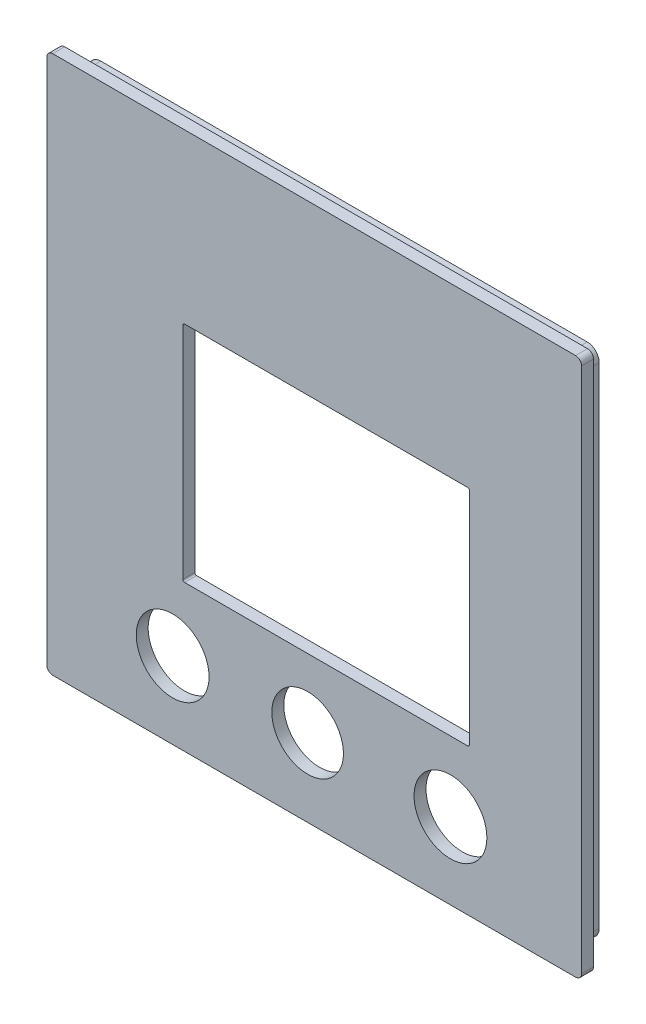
ISO-10303-21;
HEADER;
FILE_DESCRIPTION(('STEP AP214'),'2;1');
FILE_NAME('part.step','',(''),(''),'','','');
FILE_SCHEMA(('AUTOMOTIVE_DESIGN { 1 0 10303 214 1 1 1 1 }'));
ENDSEC;
DATA;
#1=APPLICATION_CONTEXT('core data for automotive mechanical design processes');
#2=APPLICATION_PROTOCOL_DEFINITION('international standard','automotive_design',2000,#1);
#3=PRODUCT_CONTEXT('',#1,'mechanical');
#4=PRODUCT('Part','Part','',(#3));
#5=PRODUCT_RELATED_PRODUCT_CATEGORY('part','',(#4));
#6=PRODUCT_DEFINITION_FORMATION('','',#4);
#7=PRODUCT_DEFINITION_CONTEXT('part definition',#1,'design');
#8=PRODUCT_DEFINITION('design','',#6,#7);
#9=PRODUCT_DEFINITION_SHAPE('','',#8);
#10=(LENGTH_UNIT() NAMED_UNIT(*) SI_UNIT(.MILLI.,.METRE.));
#11=(NAMED_UNIT(*) PLANE_ANGLE_UNIT() SI_UNIT($,.RADIAN.));
#12=(NAMED_UNIT(*) SI_UNIT($,.STERADIAN.) SOLID_ANGLE_UNIT());
#13=UNCERTAINTY_MEASURE_WITH_UNIT(LENGTH_MEASURE(1.E-05),#10,'distance_accuracy_value','');
#14=(GEOMETRIC_REPRESENTATION_CONTEXT(3) GLOBAL_UNCERTAINTY_ASSIGNED_CONTEXT((#13)) GLOBAL_UNIT_ASSIGNED_CONTEXT((#10,
#11,#12)) REPRESENTATION_CONTEXT('',''));
#15=CARTESIAN_POINT('',(0.,0.,0.));
#16=DIRECTION('',(0.,0.,1.));
#17=DIRECTION('',(1.,0.,0.));
#18=AXIS2_PLACEMENT_3D('',#15,#16,#17);
#19=CARTESIAN_POINT('',(0.,0.,0.));
#20=DIRECTION('',(0.,0.,1.));
#21=DIRECTION('',(1.,0.,0.));
#22=AXIS2_PLACEMENT_3D('',#19,#20,#21);
#23=PLANE('',#22);
#24=DIRECTION('',(0.,-1.,0.));
#25=VECTOR('',#24,1.);
#26=CARTESIAN_POINT('',(-112.975,-14.244211,0.));
#27=LINE('',#26,#25);
#28=CARTESIAN_POINT('',(-112.975,-15.244211,0.));
#29=VERTEX_POINT('',#28);
#30=CARTESIAN_POINT('',(-112.975,-103.444211,0.));
#31=VERTEX_POINT('',#30);
#32=EDGE_CURVE('E444',#29,#31,#27,.T.);
#33=ORIENTED_EDGE('',*,*,#32,.F.);
#34=CARTESIAN_POINT('',(-111.975,-15.244211,0.));
#35=DIRECTION('',(0.,0.,-1.));
#36=DIRECTION('',(-1.,0.,0.));
#37=AXIS2_PLACEMENT_3D('',#34,#35,#36);
#38=CIRCLE('',#37,1.);
#39=CARTESIAN_POINT('',(-111.975,-14.244211,0.));
#40=VERTEX_POINT('',#39);
#41=EDGE_CURVE('E605',#29,#40,#38,.T.);
#42=ORIENTED_EDGE('',*,*,#41,.T.);
#43=DIRECTION('',(-1.,0.,0.));
#44=VECTOR('',#43,1.);
#45=CARTESIAN_POINT('',(-112.975,-14.244211,0.));
#46=LINE('',#45,#44);
#47=CARTESIAN_POINT('',(-24.375,-14.244211,0.));
#48=VERTEX_POINT('',#47);
#49=EDGE_CURVE('E440',#48,#40,#46,.T.);
#50=ORIENTED_EDGE('',*,*,#49,.F.);
#51=CARTESIAN_POINT('',(-24.375,-15.244211,0.));
#52=DIRECTION('',(0.,0.,-1.));
#53=DIRECTION('',(-1.,0.,0.));
#54=AXIS2_PLACEMENT_3D('',#51,#52,#53);
#55=CIRCLE('',#54,1.);
#56=CARTESIAN_POINT('',(-23.375,-15.244211,0.));
#57=VERTEX_POINT('',#56);
#58=EDGE_CURVE('E602',#48,#57,#55,.T.);
#59=ORIENTED_EDGE('',*,*,#58,.T.);
#60=DIRECTION('',(0.,1.,0.));
#61=VECTOR('',#60,1.);
#62=CARTESIAN_POINT('',(-23.375,-14.244211,0.));
#63=LINE('',#62,#61);
#64=CARTESIAN_POINT('',(-23.375,-103.444211,0.));
#65=VERTEX_POINT('',#64);
#66=EDGE_CURVE('E453',#65,#57,#63,.T.);
#67=ORIENTED_EDGE('',*,*,#66,.F.);
#68=CARTESIAN_POINT('',(-24.375,-103.444211,0.));
#69=DIRECTION('',(0.,0.,-1.));
#70=DIRECTION('',(-1.,0.,0.));
#71=AXIS2_PLACEMENT_3D('',#68,#69,#70);
#72=CIRCLE('',#71,1.);
#73=CARTESIAN_POINT('',(-24.375,-104.444211,0.));
#74=VERTEX_POINT('',#73);
#75=EDGE_CURVE('E596',#65,#74,#72,.T.);
#76=ORIENTED_EDGE('',*,*,#75,.T.);
#77=DIRECTION('',(1.,0.,0.));
#78=VECTOR('',#77,1.);
#79=CARTESIAN_POINT('',(-112.975,-104.444211,0.));
#80=LINE('',#79,#78);
#81=CARTESIAN_POINT('',(-111.975,-104.444211,0.));
#82=VERTEX_POINT('',#81);
#83=EDGE_CURVE('E449',#82,#74,#80,.T.);
#84=ORIENTED_EDGE('',*,*,#83,.F.);
#85=CARTESIAN_POINT('',(-111.975,-103.444211,0.));
#86=DIRECTION('',(0.,0.,-1.));
#87=DIRECTION('',(-1.,0.,0.));
#88=AXIS2_PLACEMENT_3D('',#85,#86,#87);
#89=CIRCLE('',#88,1.);
#90=EDGE_CURVE('E599',#82,#31,#89,.T.);
#91=ORIENTED_EDGE('',*,*,#90,.T.);
#92=EDGE_LOOP('',(#33,#42,#50,#59,#67,#76,#84,#91));
#93=FACE_BOUND('',#92,.T.);
#94=CARTESIAN_POINT('',(-108.925,-18.294211,0.));
#95=DIRECTION('',(0.,0.,-1.));
#96=DIRECTION('',(1.,0.,0.));
#97=AXIS2_PLACEMENT_3D('',#94,#95,#96);
#98=CIRCLE('',#97,2.);
#99=CARTESIAN_POINT('',(-110.925,-18.294211,0.));
#100=VERTEX_POINT('',#99);
#101=CARTESIAN_POINT('',(-108.925,-16.294211,0.));
#102=VERTEX_POINT('',#101);
#103=EDGE_CURVE('E273',#100,#102,#98,.T.);
#104=ORIENTED_EDGE('',*,*,#103,.F.);
#105=DIRECTION('',(0.,1.,0.));
#106=VECTOR('',#105,1.);
#107=CARTESIAN_POINT('',(-110.925,-18.294211,0.));
#108=LINE('',#107,#106);
#109=CARTESIAN_POINT('',(-110.925,-100.394211,0.));
#110=VERTEX_POINT('',#109);
#111=EDGE_CURVE('E353',#110,#100,#108,.T.);
#112=ORIENTED_EDGE('',*,*,#111,.F.);
#113=CARTESIAN_POINT('',(-108.925,-100.394211,0.));
#114=DIRECTION('',(0.,0.,-1.));
#115=DIRECTION('',(-1.,0.,0.));
#116=AXIS2_PLACEMENT_3D('',#113,#114,#115);
#117=CIRCLE('',#116,1.99999999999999);
#118=CARTESIAN_POINT('',(-108.925,-102.394211,0.));
#119=VERTEX_POINT('',#118);
#120=EDGE_CURVE('E394',#119,#110,#117,.T.);
#121=ORIENTED_EDGE('',*,*,#120,.F.);
#122=DIRECTION('',(-1.,0.,0.));
#123=VECTOR('',#122,1.);
#124=CARTESIAN_POINT('',(-27.425,-102.394211,0.));
#125=LINE('',#124,#123);
#126=CARTESIAN_POINT('',(-27.425,-102.394211,0.));
#127=VERTEX_POINT('',#126);
#128=EDGE_CURVE('E390',#127,#119,#125,.T.);
#129=ORIENTED_EDGE('',*,*,#128,.F.);
#130=CARTESIAN_POINT('',(-27.425,-100.394211,0.));
#131=DIRECTION('',(0.,0.,-1.));
#132=DIRECTION('',(-1.,0.,0.));
#133=AXIS2_PLACEMENT_3D('',#130,#131,#132);
#134=CIRCLE('',#133,2.);
#135=CARTESIAN_POINT('',(-25.425,-100.394211,0.));
#136=VERTEX_POINT('',#135);
#137=EDGE_CURVE('E386',#136,#127,#134,.T.);
#138=ORIENTED_EDGE('',*,*,#137,.F.);
#139=DIRECTION('',(0.,-1.,0.));
#140=VECTOR('',#139,1.);
#141=CARTESIAN_POINT('',(-25.425,-18.294211,0.));
#142=LINE('',#141,#140);
#143=CARTESIAN_POINT('',(-25.425,-18.294211,0.));
#144=VERTEX_POINT('',#143);
#145=EDGE_CURVE('E382',#144,#136,#142,.T.);
#146=ORIENTED_EDGE('',*,*,#145,.F.);
#147=CARTESIAN_POINT('',(-27.425,-18.294211,0.));
#148=DIRECTION('',(0.,0.,-1.));
#149=DIRECTION('',(-1.,0.,0.));
#150=AXIS2_PLACEMENT_3D('',#147,#148,#149);
#151=CIRCLE('',#150,2.);
#152=CARTESIAN_POINT('',(-27.425,-16.294211,0.));
#153=VERTEX_POINT('',#152);
#154=EDGE_CURVE('E66',#153,#144,#151,.T.);
#155=ORIENTED_EDGE('',*,*,#154,.F.);
#156=DIRECTION('',(1.,0.,0.));
#157=VECTOR('',#156,1.);
#158=CARTESIAN_POINT('',(-27.425,-16.294211,0.));
#159=LINE('',#158,#157);
#160=EDGE_CURVE('E61',#102,#153,#159,.T.);
#161=ORIENTED_EDGE('',*,*,#160,.F.);
#162=EDGE_LOOP('',(#104,#112,#121,#129,#138,#146,#155,#161));
#163=FACE_BOUND('',#162,.T.);
#164=ADVANCED_FACE('F45',(#93,#163),#23,.F.);
#165=CARTESIAN_POINT('',(-42.1750000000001,0.,2.));
#166=DIRECTION('',(-1.,0.,0.));
#167=DIRECTION('',(0.,-1.,0.));
#168=AXIS2_PLACEMENT_3D('',#165,#166,#167);
#169=PLANE('',#168);
#170=DIRECTION('',(0.,1.,0.));
#171=VECTOR('',#170,1.);
#172=CARTESIAN_POINT('',(-42.1750000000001,0.,0.));
#173=LINE('',#172,#171);
#174=CARTESIAN_POINT('',(-42.175,-79.624211,0.));
#175=VERTEX_POINT('',#174);
#176=CARTESIAN_POINT('',(-42.175,-42.724211,0.));
#177=VERTEX_POINT('',#176);
#178=EDGE_CURVE('E504',#175,#177,#173,.T.);
#179=ORIENTED_EDGE('',*,*,#178,.F.);
#180=DIRECTION('',(0.,0.,-1.));
#181=VECTOR('',#180,1.);
#182=CARTESIAN_POINT('',(-42.175,-79.624211,2.));
#183=LINE('',#182,#181);
#184=CARTESIAN_POINT('',(-42.175,-79.624211,2.));
#185=VERTEX_POINT('',#184);
#186=EDGE_CURVE('E521',#175,#185,#183,.F.);
#187=ORIENTED_EDGE('',*,*,#186,.T.);
#188=DIRECTION('',(0.,1.,0.));
#189=VECTOR('',#188,1.);
#190=CARTESIAN_POINT('',(-42.1750000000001,0.,2.));
#191=LINE('',#190,#189);
#192=CARTESIAN_POINT('',(-42.175,-42.724211,2.));
#193=VERTEX_POINT('',#192);
#194=EDGE_CURVE('E485',#185,#193,#191,.T.);
#195=ORIENTED_EDGE('',*,*,#194,.T.);
#196=DIRECTION('',(0.,0.,-1.));
#197=VECTOR('',#196,1.);
#198=CARTESIAN_POINT('',(-42.175,-42.724211,0.));
#199=LINE('',#198,#197);
#200=EDGE_CURVE('E517',#193,#177,#199,.T.);
#201=ORIENTED_EDGE('',*,*,#200,.T.);
#202=EDGE_LOOP('',(#179,#187,#195,#201));
#203=FACE_BOUND('',#202,.T.);
#204=ADVANCED_FACE('F663',(#203),#169,.T.);
#205=CARTESIAN_POINT('',(0.,-79.9242109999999,2.));
#206=DIRECTION('',(0.,1.,0.));
#207=DIRECTION('',(-1.,0.,0.));
#208=AXIS2_PLACEMENT_3D('',#205,#206,#207);
#209=PLANE('',#208);
#210=DIRECTION('',(1.,0.,0.));
#211=VECTOR('',#210,1.);
#212=CARTESIAN_POINT('',(0.,-79.9242109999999,0.));
#213=LINE('',#212,#211);
#214=CARTESIAN_POINT('',(-89.875,-79.924211,0.));
#215=VERTEX_POINT('',#214);
#216=CARTESIAN_POINT('',(-42.475,-79.924211,0.));
#217=VERTEX_POINT('',#216);
#218=EDGE_CURVE('E508',#215,#217,#213,.T.);
#219=ORIENTED_EDGE('',*,*,#218,.F.);
#220=DIRECTION('',(0.,0.,1.));
#221=VECTOR('',#220,1.);
#222=CARTESIAN_POINT('',(-89.875,-79.924211,2.));
#223=LINE('',#222,#221);
#224=CARTESIAN_POINT('',(-89.875,-79.924211,2.));
#225=VERTEX_POINT('',#224);
#226=EDGE_CURVE('E554',#215,#225,#223,.T.);
#227=ORIENTED_EDGE('',*,*,#226,.T.);
#228=DIRECTION('',(1.,0.,0.));
#229=VECTOR('',#228,1.);
#230=CARTESIAN_POINT('',(0.,-79.9242109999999,2.));
#231=LINE('',#230,#229);
#232=CARTESIAN_POINT('',(-42.475,-79.924211,2.));
#233=VERTEX_POINT('',#232);
#234=EDGE_CURVE('E489',#225,#233,#231,.T.);
#235=ORIENTED_EDGE('',*,*,#234,.T.);
#236=DIRECTION('',(0.,0.,-1.));
#237=VECTOR('',#236,1.);
#238=CARTESIAN_POINT('',(-42.475,-79.924211,0.));
#239=LINE('',#238,#237);
#240=EDGE_CURVE('E496',#233,#217,#239,.T.);
#241=ORIENTED_EDGE('',*,*,#240,.T.);
#242=EDGE_LOOP('',(#219,#227,#235,#241));
#243=FACE_BOUND('',#242,.T.);
#244=ADVANCED_FACE('F669',(#243),#209,.T.);
#245=CARTESIAN_POINT('',(0.,-42.4242109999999,2.));
#246=DIRECTION('',(0.,-1.,0.));
#247=DIRECTION('',(1.,0.,0.));
#248=AXIS2_PLACEMENT_3D('',#245,#246,#247);
#249=PLANE('',#248);
#250=DIRECTION('',(-1.,0.,0.));
#251=VECTOR('',#250,1.);
#252=CARTESIAN_POINT('',(0.,-42.4242109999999,2.));
#253=LINE('',#252,#251);
#254=CARTESIAN_POINT('',(-42.475,-42.424211,2.));
#255=VERTEX_POINT('',#254);
#256=CARTESIAN_POINT('',(-89.8750000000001,-42.424211,2.));
#257=VERTEX_POINT('',#256);
#258=EDGE_CURVE('E492',#255,#257,#253,.T.);
#259=ORIENTED_EDGE('',*,*,#258,.T.);
#260=DIRECTION('',(0.,0.,1.));
#261=VECTOR('',#260,1.);
#262=CARTESIAN_POINT('',(-89.8750000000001,-42.424211,0.));
#263=LINE('',#262,#261);
#264=CARTESIAN_POINT('',(-89.8750000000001,-42.424211,0.));
#265=VERTEX_POINT('',#264);
#266=EDGE_CURVE('E551',#257,#265,#263,.F.);
#267=ORIENTED_EDGE('',*,*,#266,.T.);
#268=DIRECTION('',(-1.,0.,0.));
#269=VECTOR('',#268,1.);
#270=CARTESIAN_POINT('',(0.,-42.4242109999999,0.));
#271=LINE('',#270,#269);
#272=CARTESIAN_POINT('',(-42.475,-42.424211,0.));
#273=VERTEX_POINT('',#272);
#274=EDGE_CURVE('E481',#273,#265,#271,.T.);
#275=ORIENTED_EDGE('',*,*,#274,.F.);
#276=DIRECTION('',(0.,0.,-1.));
#277=VECTOR('',#276,1.);
#278=CARTESIAN_POINT('',(-42.475,-42.424211,2.));
#279=LINE('',#278,#277);
#280=EDGE_CURVE('E524',#273,#255,#279,.F.);
#281=ORIENTED_EDGE('',*,*,#280,.T.);
#282=EDGE_LOOP('',(#259,#267,#275,#281));
#283=FACE_BOUND('',#282,.T.);
#284=ADVANCED_FACE('F699',(#283),#249,.T.);
#285=CARTESIAN_POINT('',(-91.8933045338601,-91.5775033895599,2.));
#286=DIRECTION('',(0.,0.,-1.));
#287=DIRECTION('',(-1.,0.,0.));
#288=AXIS2_PLACEMENT_3D('',#285,#286,#287);
#289=CYLINDRICAL_SURFACE('',#288,6.09999999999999);
#290=CARTESIAN_POINT('',(-91.8933045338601,-91.5775033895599,2.));
#291=DIRECTION('',(0.,0.,1.));
#292=DIRECTION('',(1.,0.,0.));
#293=AXIS2_PLACEMENT_3D('',#290,#291,#292);
#294=CIRCLE('',#293,6.09999999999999);
#295=CARTESIAN_POINT('',(-85.7933045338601,-91.5775033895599,2.));
#296=VERTEX_POINT('',#295);
#297=EDGE_CURVE('E480',#296,#296,#294,.T.);
#298=ORIENTED_EDGE('',*,*,#297,.T.);
#299=EDGE_LOOP('',(#298));
#300=FACE_BOUND('',#299,.T.);
#301=CARTESIAN_POINT('',(-91.8933045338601,-91.5775033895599,0.));
#302=DIRECTION('',(0.,0.,1.));
#303=DIRECTION('',(1.,0.,0.));
#304=AXIS2_PLACEMENT_3D('',#301,#302,#303);
#305=CIRCLE('',#304,6.09999999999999);
#306=CARTESIAN_POINT('',(-85.7933045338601,-91.5775033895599,0.));
#307=VERTEX_POINT('',#306);
#308=EDGE_CURVE('E500',#307,#307,#305,.T.);
#309=ORIENTED_EDGE('',*,*,#308,.F.);
#310=EDGE_LOOP('',(#309));
#311=FACE_BOUND('',#310,.T.);
#312=ADVANCED_FACE('F697',(#300,#311),#289,.F.);
#313=CARTESIAN_POINT('',(-45.3451344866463,-91.6534854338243,2.));
#314=DIRECTION('',(0.,0.,-1.));
#315=DIRECTION('',(-1.,0.,0.));
#316=AXIS2_PLACEMENT_3D('',#313,#314,#315);
#317=CYLINDRICAL_SURFACE('',#316,6.1);
#318=CARTESIAN_POINT('',(-45.3451344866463,-91.6534854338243,2.));
#319=DIRECTION('',(0.,0.,1.));
#320=DIRECTION('',(1.,0.,0.));
#321=AXIS2_PLACEMENT_3D('',#318,#319,#320);
#322=CIRCLE('',#321,6.1);
#323=CARTESIAN_POINT('',(-39.2451344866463,-91.6534854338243,2.));
#324=VERTEX_POINT('',#323);
#325=EDGE_CURVE('E476',#324,#324,#322,.T.);
#326=ORIENTED_EDGE('',*,*,#325,.T.);
#327=EDGE_LOOP('',(#326));
#328=FACE_BOUND('',#327,.T.);
#329=CARTESIAN_POINT('',(-45.3451344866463,-91.6534854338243,0.));
#330=DIRECTION('',(0.,0.,1.));
#331=DIRECTION('',(1.,0.,0.));
#332=AXIS2_PLACEMENT_3D('',#329,#330,#331);
#333=CIRCLE('',#332,6.1);
#334=CARTESIAN_POINT('',(-39.2451344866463,-91.6534854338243,0.));
#335=VERTEX_POINT('',#334);
#336=EDGE_CURVE('E475',#335,#335,#333,.T.);
#337=ORIENTED_EDGE('',*,*,#336,.F.);
#338=EDGE_LOOP('',(#337));
#339=FACE_BOUND('',#338,.T.);
#340=ADVANCED_FACE('F684',(#328,#339),#317,.F.);
#341=CARTESIAN_POINT('',(0.,0.,2.));
#342=DIRECTION('',(0.,0.,1.));
#343=DIRECTION('',(1.,0.,0.));
#344=AXIS2_PLACEMENT_3D('',#341,#342,#343);
#345=PLANE('',#344);
#346=ORIENTED_EDGE('',*,*,#234,.F.);
#347=CARTESIAN_POINT('',(-89.875,-79.624211,2.));
#348=DIRECTION('',(0.,0.,1.));
#349=DIRECTION('',(1.,0.,0.));
#350=AXIS2_PLACEMENT_3D('',#347,#348,#349);
#351=CIRCLE('',#350,0.3);
#352=CARTESIAN_POINT('',(-90.175,-79.624211,2.));
#353=VERTEX_POINT('',#352);
#354=EDGE_CURVE('E564',#225,#353,#351,.F.);
#355=ORIENTED_EDGE('',*,*,#354,.T.);
#356=DIRECTION('',(0.,1.,0.));
#357=VECTOR('',#356,1.);
#358=CARTESIAN_POINT('',(-90.175,-42.424211,2.));
#359=LINE('',#358,#357);
#360=CARTESIAN_POINT('',(-90.175,-42.724211,2.));
#361=VERTEX_POINT('',#360);
#362=EDGE_CURVE('E431',#353,#361,#359,.T.);
#363=ORIENTED_EDGE('',*,*,#362,.T.);
#364=CARTESIAN_POINT('',(-89.8750000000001,-42.724211,2.));
#365=DIRECTION('',(0.,0.,1.));
#366=DIRECTION('',(1.,0.,0.));
#367=AXIS2_PLACEMENT_3D('',#364,#365,#366);
#368=CIRCLE('',#367,0.3);
#369=EDGE_CURVE('E558',#361,#257,#368,.F.);
#370=ORIENTED_EDGE('',*,*,#369,.T.);
#371=ORIENTED_EDGE('',*,*,#258,.F.);
#372=CARTESIAN_POINT('',(-42.475,-42.724211,2.));
#373=DIRECTION('',(0.,0.,1.));
#374=DIRECTION('',(1.,0.,0.));
#375=AXIS2_PLACEMENT_3D('',#372,#373,#374);
#376=CIRCLE('',#375,0.3);
#377=EDGE_CURVE('E537',#255,#193,#376,.F.);
#378=ORIENTED_EDGE('',*,*,#377,.T.);
#379=ORIENTED_EDGE('',*,*,#194,.F.);
#380=CARTESIAN_POINT('',(-42.475,-79.624211,2.));
#381=DIRECTION('',(0.,0.,1.));
#382=DIRECTION('',(1.,0.,0.));
#383=AXIS2_PLACEMENT_3D('',#380,#381,#382);
#384=CIRCLE('',#383,0.3);
#385=EDGE_CURVE('E530',#185,#233,#384,.F.);
#386=ORIENTED_EDGE('',*,*,#385,.T.);
#387=EDGE_LOOP('',(#346,#355,#363,#370,#371,#378,#379,#386));
#388=FACE_BOUND('',#387,.T.);
#389=CARTESIAN_POINT('',(-69.275,-91.444211,2.));
#390=DIRECTION('',(0.,0.,1.));
#391=DIRECTION('',(1.,0.,0.));
#392=AXIS2_PLACEMENT_3D('',#389,#390,#391);
#393=CIRCLE('',#392,6.);
#394=CARTESIAN_POINT('',(-63.275,-91.444211,2.));
#395=VERTEX_POINT('',#394);
#396=EDGE_CURVE('E457',#395,#395,#393,.T.);
#397=ORIENTED_EDGE('',*,*,#396,.F.);
#398=EDGE_LOOP('',(#397));
#399=FACE_BOUND('',#398,.T.);
#400=ORIENTED_EDGE('',*,*,#325,.F.);
#401=EDGE_LOOP('',(#400));
#402=FACE_BOUND('',#401,.T.);
#403=ORIENTED_EDGE('',*,*,#297,.F.);
#404=EDGE_LOOP('',(#403));
#405=FACE_BOUND('',#404,.T.);
#406=DIRECTION('',(-1.,0.,0.));
#407=VECTOR('',#406,1.);
#408=CARTESIAN_POINT('',(-112.975,-14.244211,2.));
#409=LINE('',#408,#407);
#410=CARTESIAN_POINT('',(-24.375,-14.244211,2.));
#411=VERTEX_POINT('',#410);
#412=CARTESIAN_POINT('',(-111.975,-14.244211,2.));
#413=VERTEX_POINT('',#412);
#414=EDGE_CURVE('E436',#411,#413,#409,.T.);
#415=ORIENTED_EDGE('',*,*,#414,.T.);
#416=CARTESIAN_POINT('',(-111.975,-15.244211,2.));
#417=DIRECTION('',(0.,0.,1.));
#418=DIRECTION('',(1.,0.,0.));
#419=AXIS2_PLACEMENT_3D('',#416,#417,#418);
#420=CIRCLE('',#419,1.);
#421=CARTESIAN_POINT('',(-112.975,-15.244211,2.));
#422=VERTEX_POINT('',#421);
#423=EDGE_CURVE('E586',#413,#422,#420,.T.);
#424=ORIENTED_EDGE('',*,*,#423,.T.);
#425=DIRECTION('',(0.,-1.,0.));
#426=VECTOR('',#425,1.);
#427=CARTESIAN_POINT('',(-112.975,-14.244211,2.));
#428=LINE('',#427,#426);
#429=CARTESIAN_POINT('',(-112.975,-103.444211,2.));
#430=VERTEX_POINT('',#429);
#431=EDGE_CURVE('E461',#422,#430,#428,.T.);
#432=ORIENTED_EDGE('',*,*,#431,.T.);
#433=CARTESIAN_POINT('',(-111.975,-103.444211,2.));
#434=DIRECTION('',(0.,0.,1.));
#435=DIRECTION('',(1.,0.,0.));
#436=AXIS2_PLACEMENT_3D('',#433,#434,#435);
#437=CIRCLE('',#436,1.);
#438=CARTESIAN_POINT('',(-111.975,-104.444211,2.));
#439=VERTEX_POINT('',#438);
#440=EDGE_CURVE('E580',#430,#439,#437,.T.);
#441=ORIENTED_EDGE('',*,*,#440,.T.);
#442=DIRECTION('',(1.,0.,0.));
#443=VECTOR('',#442,1.);
#444=CARTESIAN_POINT('',(-112.975,-104.444211,2.));
#445=LINE('',#444,#443);
#446=CARTESIAN_POINT('',(-24.375,-104.444211,2.));
#447=VERTEX_POINT('',#446);
#448=EDGE_CURVE('E465',#439,#447,#445,.T.);
#449=ORIENTED_EDGE('',*,*,#448,.T.);
#450=CARTESIAN_POINT('',(-24.375,-103.444211,2.));
#451=DIRECTION('',(0.,0.,1.));
#452=DIRECTION('',(1.,0.,0.));
#453=AXIS2_PLACEMENT_3D('',#450,#451,#452);
#454=CIRCLE('',#453,1.);
#455=CARTESIAN_POINT('',(-23.375,-103.444211,2.));
#456=VERTEX_POINT('',#455);
#457=EDGE_CURVE('E577',#447,#456,#454,.T.);
#458=ORIENTED_EDGE('',*,*,#457,.T.);
#459=DIRECTION('',(0.,1.,0.));
#460=VECTOR('',#459,1.);
#461=CARTESIAN_POINT('',(-23.375,-14.244211,2.));
#462=LINE('',#461,#460);
#463=CARTESIAN_POINT('',(-23.375,-15.244211,2.));
#464=VERTEX_POINT('',#463);
#465=EDGE_CURVE('E445',#456,#464,#462,.T.);
#466=ORIENTED_EDGE('',*,*,#465,.T.);
#467=CARTESIAN_POINT('',(-24.375,-15.244211,2.));
#468=DIRECTION('',(0.,0.,1.));
#469=DIRECTION('',(1.,0.,0.));
#470=AXIS2_PLACEMENT_3D('',#467,#468,#469);
#471=CIRCLE('',#470,1.);
#472=EDGE_CURVE('E583',#464,#411,#471,.T.);
#473=ORIENTED_EDGE('',*,*,#472,.T.);
#474=EDGE_LOOP('',(#415,#424,#432,#441,#449,#458,#466,#473));
#475=FACE_BOUND('',#474,.T.);
#476=ADVANCED_FACE('F625',(#388,#399,#402,#405,#475),#345,.T.);
#477=DIRECTION('',(1.,0.,0.));
#478=VECTOR('',#477,1.);
#479=CARTESIAN_POINT('',(-27.425,-17.794211,0.));
#480=LINE('',#479,#478);
#481=CARTESIAN_POINT('',(-108.925,-17.794211,0.));
#482=VERTEX_POINT('',#481);
#483=CARTESIAN_POINT('',(-27.425,-17.794211,0.));
#484=VERTEX_POINT('',#483);
#485=EDGE_CURVE('E265',#482,#484,#480,.T.);
#486=ORIENTED_EDGE('',*,*,#485,.T.);
#487=CARTESIAN_POINT('',(-27.425,-18.294211,0.));
#488=DIRECTION('',(0.,0.,-1.));
#489=DIRECTION('',(-1.,0.,0.));
#490=AXIS2_PLACEMENT_3D('',#487,#488,#489);
#491=CIRCLE('',#490,0.5);
#492=CARTESIAN_POINT('',(-26.925,-18.294211,0.));
#493=VERTEX_POINT('',#492);
#494=EDGE_CURVE('E301',#484,#493,#491,.T.);
#495=ORIENTED_EDGE('',*,*,#494,.T.);
#496=DIRECTION('',(0.,-1.,0.));
#497=VECTOR('',#496,1.);
#498=CARTESIAN_POINT('',(-26.925,-18.294211,0.));
#499=LINE('',#498,#497);
#500=CARTESIAN_POINT('',(-26.925,-100.394211,0.));
#501=VERTEX_POINT('',#500);
#502=EDGE_CURVE('E271',#493,#501,#499,.T.);
#503=ORIENTED_EDGE('',*,*,#502,.T.);
#504=CARTESIAN_POINT('',(-27.425,-100.394211,0.));
#505=DIRECTION('',(0.,0.,-1.));
#506=DIRECTION('',(-1.,0.,0.));
#507=AXIS2_PLACEMENT_3D('',#504,#505,#506);
#508=CIRCLE('',#507,0.5);
#509=CARTESIAN_POINT('',(-27.425,-100.894211,0.));
#510=VERTEX_POINT('',#509);
#511=EDGE_CURVE('E306',#501,#510,#508,.T.);
#512=ORIENTED_EDGE('',*,*,#511,.T.);
#513=DIRECTION('',(-1.,0.,0.));
#514=VECTOR('',#513,1.);
#515=CARTESIAN_POINT('',(-27.425,-100.894211,0.));
#516=LINE('',#515,#514);
#517=CARTESIAN_POINT('',(-108.925,-100.894211,0.));
#518=VERTEX_POINT('',#517);
#519=EDGE_CURVE('E310',#510,#518,#516,.T.);
#520=ORIENTED_EDGE('',*,*,#519,.T.);
#521=CARTESIAN_POINT('',(-108.925,-100.394211,0.));
#522=DIRECTION('',(0.,0.,-1.));
#523=DIRECTION('',(-1.,0.,0.));
#524=AXIS2_PLACEMENT_3D('',#521,#522,#523);
#525=CIRCLE('',#524,0.5);
#526=CARTESIAN_POINT('',(-109.425,-100.394211,0.));
#527=VERTEX_POINT('',#526);
#528=EDGE_CURVE('E314',#518,#527,#525,.T.);
#529=ORIENTED_EDGE('',*,*,#528,.T.);
#530=DIRECTION('',(0.,1.,0.));
#531=VECTOR('',#530,1.);
#532=CARTESIAN_POINT('',(-109.425,-18.294211,0.));
#533=LINE('',#532,#531);
#534=CARTESIAN_POINT('',(-109.425,-18.294211,0.));
#535=VERTEX_POINT('',#534);
#536=EDGE_CURVE('E318',#527,#535,#533,.T.);
#537=ORIENTED_EDGE('',*,*,#536,.T.);
#538=CARTESIAN_POINT('',(-108.925,-18.294211,0.));
#539=DIRECTION('',(0.,0.,-1.));
#540=DIRECTION('',(1.,0.,0.));
#541=AXIS2_PLACEMENT_3D('',#538,#539,#540);
#542=CIRCLE('',#541,0.5);
#543=EDGE_CURVE('E322',#535,#482,#542,.T.);
#544=ORIENTED_EDGE('',*,*,#543,.T.);
#545=EDGE_LOOP('',(#486,#495,#503,#512,#520,#529,#537,#544));
#546=FACE_BOUND('',#545,.T.);
#547=ORIENTED_EDGE('',*,*,#274,.T.);
#548=CARTESIAN_POINT('',(-89.8750000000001,-42.724211,0.));
#549=DIRECTION('',(0.,0.,1.));
#550=DIRECTION('',(1.,0.,0.));
#551=AXIS2_PLACEMENT_3D('',#548,#549,#550);
#552=CIRCLE('',#551,0.3);
#553=CARTESIAN_POINT('',(-90.175,-42.724211,0.));
#554=VERTEX_POINT('',#553);
#555=EDGE_CURVE('E561',#265,#554,#552,.T.);
#556=ORIENTED_EDGE('',*,*,#555,.T.);
#557=DIRECTION('',(0.,-1.,0.));
#558=VECTOR('',#557,1.);
#559=CARTESIAN_POINT('',(-90.175,-42.424211,0.));
#560=LINE('',#559,#558);
#561=CARTESIAN_POINT('',(-90.175,-79.624211,0.));
#562=VERTEX_POINT('',#561);
#563=EDGE_CURVE('E432',#554,#562,#560,.T.);
#564=ORIENTED_EDGE('',*,*,#563,.T.);
#565=CARTESIAN_POINT('',(-89.875,-79.624211,0.));
#566=DIRECTION('',(0.,0.,1.));
#567=DIRECTION('',(1.,0.,0.));
#568=AXIS2_PLACEMENT_3D('',#565,#566,#567);
#569=CIRCLE('',#568,0.3);
#570=EDGE_CURVE('E567',#562,#215,#569,.T.);
#571=ORIENTED_EDGE('',*,*,#570,.T.);
#572=ORIENTED_EDGE('',*,*,#218,.T.);
#573=CARTESIAN_POINT('',(-42.475,-79.624211,0.));
#574=DIRECTION('',(0.,0.,1.));
#575=DIRECTION('',(1.,0.,0.));
#576=AXIS2_PLACEMENT_3D('',#573,#574,#575);
#577=CIRCLE('',#576,0.3);
#578=EDGE_CURVE('E527',#217,#175,#577,.T.);
#579=ORIENTED_EDGE('',*,*,#578,.T.);
#580=ORIENTED_EDGE('',*,*,#178,.T.);
#581=CARTESIAN_POINT('',(-42.475,-42.724211,0.));
#582=DIRECTION('',(0.,0.,1.));
#583=DIRECTION('',(1.,0.,0.));
#584=AXIS2_PLACEMENT_3D('',#581,#582,#583);
#585=CIRCLE('',#584,0.3);
#586=EDGE_CURVE('E534',#177,#273,#585,.T.);
#587=ORIENTED_EDGE('',*,*,#586,.T.);
#588=EDGE_LOOP('',(#547,#556,#564,#571,#572,#579,#580,#587));
#589=FACE_BOUND('',#588,.T.);
#590=CARTESIAN_POINT('',(-69.275,-91.444211,0.));
#591=DIRECTION('',(0.,0.,1.));
#592=DIRECTION('',(1.,0.,0.));
#593=AXIS2_PLACEMENT_3D('',#590,#591,#592);
#594=CIRCLE('',#593,6.);
#595=CARTESIAN_POINT('',(-63.275,-91.444211,0.));
#596=VERTEX_POINT('',#595);
#597=EDGE_CURVE('E540',#596,#596,#594,.T.);
#598=ORIENTED_EDGE('',*,*,#597,.T.);
#599=EDGE_LOOP('',(#598));
#600=FACE_BOUND('',#599,.T.);
#601=ORIENTED_EDGE('',*,*,#336,.T.);
#602=EDGE_LOOP('',(#601));
#603=FACE_BOUND('',#602,.T.);
#604=ORIENTED_EDGE('',*,*,#308,.T.);
#605=EDGE_LOOP('',(#604));
#606=FACE_BOUND('',#605,.T.);
#607=ADVANCED_FACE('F665',(#546,#589,#600,#603,#606),#23,.F.);
#608=CARTESIAN_POINT('',(-42.475,-79.624211,2.));
#609=DIRECTION('',(0.,0.,1.));
#610=DIRECTION('',(1.,0.,0.));
#611=AXIS2_PLACEMENT_3D('',#608,#609,#610);
#612=CYLINDRICAL_SURFACE('',#611,0.3);
#613=ORIENTED_EDGE('',*,*,#385,.F.);
#614=ORIENTED_EDGE('',*,*,#186,.F.);
#615=ORIENTED_EDGE('',*,*,#578,.F.);
#616=ORIENTED_EDGE('',*,*,#240,.F.);
#617=EDGE_LOOP('',(#613,#614,#615,#616));
#618=FACE_BOUND('',#617,.T.);
#619=ADVANCED_FACE('F675',(#618),#612,.F.);
#620=CARTESIAN_POINT('',(-42.475,-42.724211,2.));
#621=DIRECTION('',(0.,0.,1.));
#622=DIRECTION('',(1.,0.,0.));
#623=AXIS2_PLACEMENT_3D('',#620,#621,#622);
#624=CYLINDRICAL_SURFACE('',#623,0.3);
#625=ORIENTED_EDGE('',*,*,#377,.F.);
#626=ORIENTED_EDGE('',*,*,#280,.F.);
#627=ORIENTED_EDGE('',*,*,#586,.F.);
#628=ORIENTED_EDGE('',*,*,#200,.F.);
#629=EDGE_LOOP('',(#625,#626,#627,#628));
#630=FACE_BOUND('',#629,.T.);
#631=ADVANCED_FACE('F681',(#630),#624,.F.);
#632=CARTESIAN_POINT('',(-69.275,-91.444211,-1.));
#633=DIRECTION('',(0.,0.,1.));
#634=DIRECTION('',(1.,0.,0.));
#635=AXIS2_PLACEMENT_3D('',#632,#633,#634);
#636=CYLINDRICAL_SURFACE('',#635,6.);
#637=ORIENTED_EDGE('',*,*,#396,.T.);
#638=EDGE_LOOP('',(#637));
#639=FACE_BOUND('',#638,.T.);
#640=ORIENTED_EDGE('',*,*,#597,.F.);
#641=EDGE_LOOP('',(#640));
#642=FACE_BOUND('',#641,.T.);
#643=ADVANCED_FACE('F713',(#639,#642),#636,.F.);
#644=CARTESIAN_POINT('',(-112.975,-14.244211,0.));
#645=DIRECTION('',(0.,1.,0.));
#646=DIRECTION('',(0.,0.,1.));
#647=AXIS2_PLACEMENT_3D('',#644,#645,#646);
#648=PLANE('',#647);
#649=ORIENTED_EDGE('',*,*,#49,.T.);
#650=DIRECTION('',(0.,0.,1.));
#651=VECTOR('',#650,1.);
#652=CARTESIAN_POINT('',(-111.975,-14.244211,0.));
#653=LINE('',#652,#651);
#654=EDGE_CURVE('E573',#40,#413,#653,.T.);
#655=ORIENTED_EDGE('',*,*,#654,.T.);
#656=ORIENTED_EDGE('',*,*,#414,.F.);
#657=DIRECTION('',(0.,0.,1.));
#658=VECTOR('',#657,1.);
#659=CARTESIAN_POINT('',(-24.375,-14.244211,0.));
#660=LINE('',#659,#658);
#661=EDGE_CURVE('E570',#411,#48,#660,.F.);
#662=ORIENTED_EDGE('',*,*,#661,.T.);
#663=EDGE_LOOP('',(#649,#655,#656,#662));
#664=FACE_BOUND('',#663,.T.);
#665=ADVANCED_FACE('F644',(#664),#648,.T.);
#666=CARTESIAN_POINT('',(-23.375,-14.244211,0.));
#667=DIRECTION('',(1.,0.,0.));
#668=DIRECTION('',(0.,1.,0.));
#669=AXIS2_PLACEMENT_3D('',#666,#667,#668);
#670=PLANE('',#669);
#671=ORIENTED_EDGE('',*,*,#66,.T.);
#672=DIRECTION('',(0.,0.,1.));
#673=VECTOR('',#672,1.);
#674=CARTESIAN_POINT('',(-23.375,-15.244211,0.));
#675=LINE('',#674,#673);
#676=EDGE_CURVE('E611',#57,#464,#675,.T.);
#677=ORIENTED_EDGE('',*,*,#676,.T.);
#678=ORIENTED_EDGE('',*,*,#465,.F.);
#679=DIRECTION('',(0.,0.,1.));
#680=VECTOR('',#679,1.);
#681=CARTESIAN_POINT('',(-23.375,-103.444211,0.));
#682=LINE('',#681,#680);
#683=EDGE_CURVE('E608',#456,#65,#682,.F.);
#684=ORIENTED_EDGE('',*,*,#683,.T.);
#685=EDGE_LOOP('',(#671,#677,#678,#684));
#686=FACE_BOUND('',#685,.T.);
#687=ADVANCED_FACE('F651',(#686),#670,.T.);
#688=CARTESIAN_POINT('',(-112.975,-104.444211,0.));
#689=DIRECTION('',(0.,-1.,0.));
#690=DIRECTION('',(0.,0.,-1.));
#691=AXIS2_PLACEMENT_3D('',#688,#689,#690);
#692=PLANE('',#691);
#693=ORIENTED_EDGE('',*,*,#448,.F.);
#694=DIRECTION('',(0.,0.,1.));
#695=VECTOR('',#694,1.);
#696=CARTESIAN_POINT('',(-111.975,-104.444211,0.));
#697=LINE('',#696,#695);
#698=EDGE_CURVE('E11',#439,#82,#697,.F.);
#699=ORIENTED_EDGE('',*,*,#698,.T.);
#700=ORIENTED_EDGE('',*,*,#83,.T.);
#701=DIRECTION('',(0.,0.,1.));
#702=VECTOR('',#701,1.);
#703=CARTESIAN_POINT('',(-24.375,-104.444211,0.));
#704=LINE('',#703,#702);
#705=EDGE_CURVE('E54',#74,#447,#704,.T.);
#706=ORIENTED_EDGE('',*,*,#705,.T.);
#707=EDGE_LOOP('',(#693,#699,#700,#706));
#708=FACE_BOUND('',#707,.T.);
#709=ADVANCED_FACE('F619',(#708),#692,.T.);
#710=CARTESIAN_POINT('',(-112.975,-14.244211,0.));
#711=DIRECTION('',(-1.,0.,0.));
#712=DIRECTION('',(0.,0.,1.));
#713=AXIS2_PLACEMENT_3D('',#710,#711,#712);
#714=PLANE('',#713);
#715=ORIENTED_EDGE('',*,*,#431,.F.);
#716=DIRECTION('',(0.,0.,1.));
#717=VECTOR('',#716,1.);
#718=CARTESIAN_POINT('',(-112.975,-15.244211,0.));
#719=LINE('',#718,#717);
#720=EDGE_CURVE('E593',#422,#29,#719,.F.);
#721=ORIENTED_EDGE('',*,*,#720,.T.);
#722=ORIENTED_EDGE('',*,*,#32,.T.);
#723=DIRECTION('',(0.,0.,1.));
#724=VECTOR('',#723,1.);
#725=CARTESIAN_POINT('',(-112.975,-103.444211,0.));
#726=LINE('',#725,#724);
#727=EDGE_CURVE('E589',#31,#430,#726,.T.);
#728=ORIENTED_EDGE('',*,*,#727,.T.);
#729=EDGE_LOOP('',(#715,#721,#722,#728));
#730=FACE_BOUND('',#729,.T.);
#731=ADVANCED_FACE('F633',(#730),#714,.T.);
#732=CARTESIAN_POINT('',(-90.175,-42.424211,-37.9769667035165));
#733=DIRECTION('',(1.,0.,0.));
#734=DIRECTION('',(0.,1.,0.));
#735=AXIS2_PLACEMENT_3D('',#732,#733,#734);
#736=PLANE('',#735);
#737=ORIENTED_EDGE('',*,*,#563,.F.);
#738=DIRECTION('',(0.,0.,1.));
#739=VECTOR('',#738,1.);
#740=CARTESIAN_POINT('',(-90.175,-42.724211,2.));
#741=LINE('',#740,#739);
#742=EDGE_CURVE('E547',#554,#361,#741,.T.);
#743=ORIENTED_EDGE('',*,*,#742,.T.);
#744=ORIENTED_EDGE('',*,*,#362,.F.);
#745=DIRECTION('',(0.,0.,1.));
#746=VECTOR('',#745,1.);
#747=CARTESIAN_POINT('',(-90.175,-79.624211,0.));
#748=LINE('',#747,#746);
#749=EDGE_CURVE('E544',#353,#562,#748,.F.);
#750=ORIENTED_EDGE('',*,*,#749,.T.);
#751=EDGE_LOOP('',(#737,#743,#744,#750));
#752=FACE_BOUND('',#751,.T.);
#753=ADVANCED_FACE('F719',(#752),#736,.T.);
#754=CARTESIAN_POINT('',(-89.8750000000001,-42.724211,-37.9769667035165));
#755=DIRECTION('',(0.,0.,-1.));
#756=DIRECTION('',(-1.,0.,0.));
#757=AXIS2_PLACEMENT_3D('',#754,#755,#756);
#758=CYLINDRICAL_SURFACE('',#757,0.3);
#759=ORIENTED_EDGE('',*,*,#555,.F.);
#760=ORIENTED_EDGE('',*,*,#266,.F.);
#761=ORIENTED_EDGE('',*,*,#369,.F.);
#762=ORIENTED_EDGE('',*,*,#742,.F.);
#763=EDGE_LOOP('',(#759,#760,#761,#762));
#764=FACE_BOUND('',#763,.T.);
#765=ADVANCED_FACE('F715',(#764),#758,.F.);
#766=CARTESIAN_POINT('',(-89.875,-79.624211,2.));
#767=DIRECTION('',(0.,0.,-1.));
#768=DIRECTION('',(-1.,0.,0.));
#769=AXIS2_PLACEMENT_3D('',#766,#767,#768);
#770=CYLINDRICAL_SURFACE('',#769,0.3);
#771=ORIENTED_EDGE('',*,*,#570,.F.);
#772=ORIENTED_EDGE('',*,*,#749,.F.);
#773=ORIENTED_EDGE('',*,*,#354,.F.);
#774=ORIENTED_EDGE('',*,*,#226,.F.);
#775=EDGE_LOOP('',(#771,#772,#773,#774));
#776=FACE_BOUND('',#775,.T.);
#777=ADVANCED_FACE('F718',(#776),#770,.F.);
#778=CARTESIAN_POINT('',(-111.975,-15.244211,0.));
#779=DIRECTION('',(0.,0.,1.));
#780=DIRECTION('',(1.,0.,0.));
#781=AXIS2_PLACEMENT_3D('',#778,#779,#780);
#782=CYLINDRICAL_SURFACE('',#781,1.);
#783=ORIENTED_EDGE('',*,*,#41,.F.);
#784=ORIENTED_EDGE('',*,*,#720,.F.);
#785=ORIENTED_EDGE('',*,*,#423,.F.);
#786=ORIENTED_EDGE('',*,*,#654,.F.);
#787=EDGE_LOOP('',(#783,#784,#785,#786));
#788=FACE_BOUND('',#787,.T.);
#789=ADVANCED_FACE('F641',(#788),#782,.T.);
#790=CARTESIAN_POINT('',(-24.375,-15.244211,0.));
#791=DIRECTION('',(0.,0.,1.));
#792=DIRECTION('',(1.,0.,0.));
#793=AXIS2_PLACEMENT_3D('',#790,#791,#792);
#794=CYLINDRICAL_SURFACE('',#793,1.);
#795=ORIENTED_EDGE('',*,*,#58,.F.);
#796=ORIENTED_EDGE('',*,*,#661,.F.);
#797=ORIENTED_EDGE('',*,*,#472,.F.);
#798=ORIENTED_EDGE('',*,*,#676,.F.);
#799=EDGE_LOOP('',(#795,#796,#797,#798));
#800=FACE_BOUND('',#799,.T.);
#801=ADVANCED_FACE('F649',(#800),#794,.T.);
#802=CARTESIAN_POINT('',(-111.975,-103.444211,0.));
#803=DIRECTION('',(0.,0.,1.));
#804=DIRECTION('',(1.,0.,0.));
#805=AXIS2_PLACEMENT_3D('',#802,#803,#804);
#806=CYLINDRICAL_SURFACE('',#805,1.);
#807=ORIENTED_EDGE('',*,*,#90,.F.);
#808=ORIENTED_EDGE('',*,*,#698,.F.);
#809=ORIENTED_EDGE('',*,*,#440,.F.);
#810=ORIENTED_EDGE('',*,*,#727,.F.);
#811=EDGE_LOOP('',(#807,#808,#809,#810));
#812=FACE_BOUND('',#811,.T.);
#813=ADVANCED_FACE('F631',(#812),#806,.T.);
#814=CARTESIAN_POINT('',(-24.375,-103.444211,0.));
#815=DIRECTION('',(0.,0.,1.));
#816=DIRECTION('',(1.,0.,0.));
#817=AXIS2_PLACEMENT_3D('',#814,#815,#816);
#818=CYLINDRICAL_SURFACE('',#817,1.);
#819=ORIENTED_EDGE('',*,*,#75,.F.);
#820=ORIENTED_EDGE('',*,*,#683,.F.);
#821=ORIENTED_EDGE('',*,*,#457,.F.);
#822=ORIENTED_EDGE('',*,*,#705,.F.);
#823=EDGE_LOOP('',(#819,#820,#821,#822));
#824=FACE_BOUND('',#823,.T.);
#825=ADVANCED_FACE('F47',(#824),#818,.T.);
#826=CARTESIAN_POINT('',(-108.925,-18.294211,-3.));
#827=DIRECTION('',(0.,0.,1.));
#828=DIRECTION('',(1.,0.,0.));
#829=AXIS2_PLACEMENT_3D('',#826,#827,#828);
#830=PLANE('',#829);
#831=CARTESIAN_POINT('',(-108.925,-18.294211,-3.));
#832=DIRECTION('',(0.,0.,-1.));
#833=DIRECTION('',(1.,0.,0.));
#834=AXIS2_PLACEMENT_3D('',#831,#832,#833);
#835=CIRCLE('',#834,2.);
#836=CARTESIAN_POINT('',(-110.925,-18.294211,-3.));
#837=VERTEX_POINT('',#836);
#838=CARTESIAN_POINT('',(-108.925,-16.294211,-3.));
#839=VERTEX_POINT('',#838);
#840=EDGE_CURVE('E348',#837,#839,#835,.T.);
#841=ORIENTED_EDGE('',*,*,#840,.T.);
#842=DIRECTION('',(1.,0.,0.));
#843=VECTOR('',#842,1.);
#844=CARTESIAN_POINT('',(-27.425,-16.294211,-3.));
#845=LINE('',#844,#843);
#846=CARTESIAN_POINT('',(-27.425,-16.294211,-3.));
#847=VERTEX_POINT('',#846);
#848=EDGE_CURVE('E352',#839,#847,#845,.T.);
#849=ORIENTED_EDGE('',*,*,#848,.T.);
#850=CARTESIAN_POINT('',(-27.425,-18.294211,-3.));
#851=DIRECTION('',(0.,0.,-1.));
#852=DIRECTION('',(-1.,0.,0.));
#853=AXIS2_PLACEMENT_3D('',#850,#851,#852);
#854=CIRCLE('',#853,2.);
#855=CARTESIAN_POINT('',(-25.425,-18.294211,-3.));
#856=VERTEX_POINT('',#855);
#857=EDGE_CURVE('E356',#847,#856,#854,.T.);
#858=ORIENTED_EDGE('',*,*,#857,.T.);
#859=DIRECTION('',(0.,-1.,0.));
#860=VECTOR('',#859,1.);
#861=CARTESIAN_POINT('',(-25.425,-18.294211,-3.));
#862=LINE('',#861,#860);
#863=CARTESIAN_POINT('',(-25.425,-100.394211,-3.));
#864=VERTEX_POINT('',#863);
#865=EDGE_CURVE('E359',#856,#864,#862,.T.);
#866=ORIENTED_EDGE('',*,*,#865,.T.);
#867=CARTESIAN_POINT('',(-27.425,-100.394211,-3.));
#868=DIRECTION('',(0.,0.,-1.));
#869=DIRECTION('',(-1.,0.,0.));
#870=AXIS2_PLACEMENT_3D('',#867,#868,#869);
#871=CIRCLE('',#870,2.);
#872=CARTESIAN_POINT('',(-27.425,-102.394211,-3.));
#873=VERTEX_POINT('',#872);
#874=EDGE_CURVE('E362',#864,#873,#871,.T.);
#875=ORIENTED_EDGE('',*,*,#874,.T.);
#876=DIRECTION('',(-1.,0.,0.));
#877=VECTOR('',#876,1.);
#878=CARTESIAN_POINT('',(-27.425,-102.394211,-3.));
#879=LINE('',#878,#877);
#880=CARTESIAN_POINT('',(-108.925,-102.394211,-3.));
#881=VERTEX_POINT('',#880);
#882=EDGE_CURVE('E365',#873,#881,#879,.T.);
#883=ORIENTED_EDGE('',*,*,#882,.T.);
#884=CARTESIAN_POINT('',(-108.925,-100.394211,-3.));
#885=DIRECTION('',(0.,0.,-1.));
#886=DIRECTION('',(-1.,0.,0.));
#887=AXIS2_PLACEMENT_3D('',#884,#885,#886);
#888=CIRCLE('',#887,1.99999999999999);
#889=CARTESIAN_POINT('',(-110.925,-100.394211,-3.));
#890=VERTEX_POINT('',#889);
#891=EDGE_CURVE('E368',#881,#890,#888,.T.);
#892=ORIENTED_EDGE('',*,*,#891,.T.);
#893=DIRECTION('',(0.,1.,0.));
#894=VECTOR('',#893,1.);
#895=CARTESIAN_POINT('',(-110.925,-18.294211,-3.));
#896=LINE('',#895,#894);
#897=EDGE_CURVE('E371',#890,#837,#896,.T.);
#898=ORIENTED_EDGE('',*,*,#897,.T.);
#899=EDGE_LOOP('',(#841,#849,#858,#866,#875,#883,#892,#898));
#900=FACE_BOUND('',#899,.T.);
#901=CARTESIAN_POINT('',(-27.425,-18.294211,-3.));
#902=DIRECTION('',(0.,0.,-1.));
#903=DIRECTION('',(-1.,0.,0.));
#904=AXIS2_PLACEMENT_3D('',#901,#902,#903);
#905=CIRCLE('',#904,0.5);
#906=CARTESIAN_POINT('',(-27.425,-17.794211,-3.));
#907=VERTEX_POINT('',#906);
#908=CARTESIAN_POINT('',(-26.925,-18.294211,-3.));
#909=VERTEX_POINT('',#908);
#910=EDGE_CURVE('E253',#907,#909,#905,.T.);
#911=ORIENTED_EDGE('',*,*,#910,.F.);
#912=DIRECTION('',(1.,0.,0.));
#913=VECTOR('',#912,1.);
#914=CARTESIAN_POINT('',(-27.425,-17.794211,-3.));
#915=LINE('',#914,#913);
#916=CARTESIAN_POINT('',(-108.925,-17.794211,-3.));
#917=VERTEX_POINT('',#916);
#918=EDGE_CURVE('E298',#917,#907,#915,.T.);
#919=ORIENTED_EDGE('',*,*,#918,.F.);
#920=CARTESIAN_POINT('',(-108.925,-18.294211,-3.));
#921=DIRECTION('',(0.,0.,-1.));
#922=DIRECTION('',(1.,0.,0.));
#923=AXIS2_PLACEMENT_3D('',#920,#921,#922);
#924=CIRCLE('',#923,0.5);
#925=CARTESIAN_POINT('',(-109.425,-18.294211,-3.));
#926=VERTEX_POINT('',#925);
#927=EDGE_CURVE('E294',#926,#917,#924,.T.);
#928=ORIENTED_EDGE('',*,*,#927,.F.);
#929=DIRECTION('',(0.,1.,0.));
#930=VECTOR('',#929,1.);
#931=CARTESIAN_POINT('',(-109.425,-18.294211,-3.));
#932=LINE('',#931,#930);
#933=CARTESIAN_POINT('',(-109.425,-100.394211,-3.));
#934=VERTEX_POINT('',#933);
#935=EDGE_CURVE('E291',#934,#926,#932,.T.);
#936=ORIENTED_EDGE('',*,*,#935,.F.);
#937=CARTESIAN_POINT('',(-108.925,-100.394211,-3.));
#938=DIRECTION('',(0.,0.,-1.));
#939=DIRECTION('',(-1.,0.,0.));
#940=AXIS2_PLACEMENT_3D('',#937,#938,#939);
#941=CIRCLE('',#940,0.5);
#942=CARTESIAN_POINT('',(-108.925,-100.894211,-3.));
#943=VERTEX_POINT('',#942);
#944=EDGE_CURVE('E288',#943,#934,#941,.T.);
#945=ORIENTED_EDGE('',*,*,#944,.F.);
#946=DIRECTION('',(-1.,0.,0.));
#947=VECTOR('',#946,1.);
#948=CARTESIAN_POINT('',(-27.425,-100.894211,-3.));
#949=LINE('',#948,#947);
#950=CARTESIAN_POINT('',(-27.425,-100.894211,-3.));
#951=VERTEX_POINT('',#950);
#952=EDGE_CURVE('E283',#951,#943,#949,.T.);
#953=ORIENTED_EDGE('',*,*,#952,.F.);
#954=CARTESIAN_POINT('',(-27.425,-100.394211,-3.));
#955=DIRECTION('',(0.,0.,-1.));
#956=DIRECTION('',(-1.,0.,0.));
#957=AXIS2_PLACEMENT_3D('',#954,#955,#956);
#958=CIRCLE('',#957,0.5);
#959=CARTESIAN_POINT('',(-26.925,-100.394211,-3.));
#960=VERTEX_POINT('',#959);
#961=EDGE_CURVE('E279',#960,#951,#958,.T.);
#962=ORIENTED_EDGE('',*,*,#961,.F.);
#963=DIRECTION('',(0.,-1.,0.));
#964=VECTOR('',#963,1.);
#965=CARTESIAN_POINT('',(-26.925,-18.294211,-3.));
#966=LINE('',#965,#964);
#967=EDGE_CURVE('E264',#909,#960,#966,.T.);
#968=ORIENTED_EDGE('',*,*,#967,.F.);
#969=EDGE_LOOP('',(#911,#919,#928,#936,#945,#953,#962,#968));
#970=FACE_BOUND('',#969,.T.);
#971=ADVANCED_FACE('F277',(#900,#970),#830,.F.);
#972=CARTESIAN_POINT('',(-108.925,-18.294211,-3.));
#973=DIRECTION('',(0.,0.,1.));
#974=DIRECTION('',(1.,0.,0.));
#975=AXIS2_PLACEMENT_3D('',#972,#973,#974);
#976=CYLINDRICAL_SURFACE('',#975,2.);
#977=ORIENTED_EDGE('',*,*,#103,.T.);
#978=DIRECTION('',(0.,0.,1.));
#979=VECTOR('',#978,1.);
#980=CARTESIAN_POINT('',(-108.925,-16.294211,-3.));
#981=LINE('',#980,#979);
#982=EDGE_CURVE('E428',#839,#102,#981,.T.);
#983=ORIENTED_EDGE('',*,*,#982,.F.);
#984=ORIENTED_EDGE('',*,*,#840,.F.);
#985=DIRECTION('',(0.,0.,1.));
#986=VECTOR('',#985,1.);
#987=CARTESIAN_POINT('',(-110.925,-18.294211,-3.));
#988=LINE('',#987,#986);
#989=EDGE_CURVE('E374',#837,#100,#988,.T.);
#990=ORIENTED_EDGE('',*,*,#989,.T.);
#991=EDGE_LOOP('',(#977,#983,#984,#990));
#992=FACE_BOUND('',#991,.T.);
#993=ADVANCED_FACE('F659',(#992),#976,.T.);
#994=CARTESIAN_POINT('',(-27.425,-16.294211,-3.));
#995=DIRECTION('',(0.,-1.,0.));
#996=DIRECTION('',(0.,0.,-1.));
#997=AXIS2_PLACEMENT_3D('',#994,#995,#996);
#998=PLANE('',#997);
#999=ORIENTED_EDGE('',*,*,#160,.T.);
#1000=DIRECTION('',(0.,0.,1.));
#1001=VECTOR('',#1000,1.);
#1002=CARTESIAN_POINT('',(-27.425,-16.294211,-3.));
#1003=LINE('',#1002,#1001);
#1004=EDGE_CURVE('E424',#847,#153,#1003,.T.);
#1005=ORIENTED_EDGE('',*,*,#1004,.F.);
#1006=ORIENTED_EDGE('',*,*,#848,.F.);
#1007=ORIENTED_EDGE('',*,*,#982,.T.);
#1008=EDGE_LOOP('',(#999,#1005,#1006,#1007));
#1009=FACE_BOUND('',#1008,.T.);
#1010=ADVANCED_FACE('F768',(#1009),#998,.F.);
#1011=CARTESIAN_POINT('',(-27.425,-18.294211,-3.));
#1012=DIRECTION('',(0.,0.,1.));
#1013=DIRECTION('',(1.,0.,0.));
#1014=AXIS2_PLACEMENT_3D('',#1011,#1012,#1013);
#1015=CYLINDRICAL_SURFACE('',#1014,2.);
#1016=ORIENTED_EDGE('',*,*,#154,.T.);
#1017=DIRECTION('',(0.,0.,1.));
#1018=VECTOR('',#1017,1.);
#1019=CARTESIAN_POINT('',(-25.425,-18.294211,-3.));
#1020=LINE('',#1019,#1018);
#1021=EDGE_CURVE('E420',#856,#144,#1020,.T.);
#1022=ORIENTED_EDGE('',*,*,#1021,.F.);
#1023=ORIENTED_EDGE('',*,*,#857,.F.);
#1024=ORIENTED_EDGE('',*,*,#1004,.T.);
#1025=EDGE_LOOP('',(#1016,#1022,#1023,#1024));
#1026=FACE_BOUND('',#1025,.T.);
#1027=ADVANCED_FACE('F779',(#1026),#1015,.T.);
#1028=CARTESIAN_POINT('',(-25.425,-18.294211,-3.));
#1029=DIRECTION('',(-1.,0.,0.));
#1030=DIRECTION('',(0.,-1.,0.));
#1031=AXIS2_PLACEMENT_3D('',#1028,#1029,#1030);
#1032=PLANE('',#1031);
#1033=ORIENTED_EDGE('',*,*,#145,.T.);
#1034=DIRECTION('',(0.,0.,1.));
#1035=VECTOR('',#1034,1.);
#1036=CARTESIAN_POINT('',(-25.425,-100.394211,-3.));
#1037=LINE('',#1036,#1035);
#1038=EDGE_CURVE('E416',#864,#136,#1037,.T.);
#1039=ORIENTED_EDGE('',*,*,#1038,.F.);
#1040=ORIENTED_EDGE('',*,*,#865,.F.);
#1041=ORIENTED_EDGE('',*,*,#1021,.T.);
#1042=EDGE_LOOP('',(#1033,#1039,#1040,#1041));
#1043=FACE_BOUND('',#1042,.T.);
#1044=ADVANCED_FACE('F790',(#1043),#1032,.F.);
#1045=CARTESIAN_POINT('',(-27.425,-100.394211,-3.));
#1046=DIRECTION('',(0.,0.,1.));
#1047=DIRECTION('',(1.,0.,0.));
#1048=AXIS2_PLACEMENT_3D('',#1045,#1046,#1047);
#1049=CYLINDRICAL_SURFACE('',#1048,2.);
#1050=ORIENTED_EDGE('',*,*,#137,.T.);
#1051=DIRECTION('',(0.,0.,1.));
#1052=VECTOR('',#1051,1.);
#1053=CARTESIAN_POINT('',(-27.425,-102.394211,-3.));
#1054=LINE('',#1053,#1052);
#1055=EDGE_CURVE('E412',#873,#127,#1054,.T.);
#1056=ORIENTED_EDGE('',*,*,#1055,.F.);
#1057=ORIENTED_EDGE('',*,*,#874,.F.);
#1058=ORIENTED_EDGE('',*,*,#1038,.T.);
#1059=EDGE_LOOP('',(#1050,#1056,#1057,#1058));
#1060=FACE_BOUND('',#1059,.T.);
#1061=ADVANCED_FACE('F801',(#1060),#1049,.T.);
#1062=CARTESIAN_POINT('',(-27.425,-102.394211,-3.));
#1063=DIRECTION('',(0.,1.,0.));
#1064=DIRECTION('',(0.,0.,1.));
#1065=AXIS2_PLACEMENT_3D('',#1062,#1063,#1064);
#1066=PLANE('',#1065);
#1067=ORIENTED_EDGE('',*,*,#128,.T.);
#1068=DIRECTION('',(0.,0.,1.));
#1069=VECTOR('',#1068,1.);
#1070=CARTESIAN_POINT('',(-108.925,-102.394211,-3.));
#1071=LINE('',#1070,#1069);
#1072=EDGE_CURVE('E408',#881,#119,#1071,.T.);
#1073=ORIENTED_EDGE('',*,*,#1072,.F.);
#1074=ORIENTED_EDGE('',*,*,#882,.F.);
#1075=ORIENTED_EDGE('',*,*,#1055,.T.);
#1076=EDGE_LOOP('',(#1067,#1073,#1074,#1075));
#1077=FACE_BOUND('',#1076,.T.);
#1078=ADVANCED_FACE('F812',(#1077),#1066,.F.);
#1079=CARTESIAN_POINT('',(-108.925,-100.394211,-3.));
#1080=DIRECTION('',(0.,0.,1.));
#1081=DIRECTION('',(1.,0.,0.));
#1082=AXIS2_PLACEMENT_3D('',#1079,#1080,#1081);
#1083=CYLINDRICAL_SURFACE('',#1082,1.99999999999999);
#1084=ORIENTED_EDGE('',*,*,#120,.T.);
#1085=DIRECTION('',(0.,0.,1.));
#1086=VECTOR('',#1085,1.);
#1087=CARTESIAN_POINT('',(-110.925,-100.394211,-3.));
#1088=LINE('',#1087,#1086);
#1089=EDGE_CURVE('E404',#890,#110,#1088,.T.);
#1090=ORIENTED_EDGE('',*,*,#1089,.F.);
#1091=ORIENTED_EDGE('',*,*,#891,.F.);
#1092=ORIENTED_EDGE('',*,*,#1072,.T.);
#1093=EDGE_LOOP('',(#1084,#1090,#1091,#1092));
#1094=FACE_BOUND('',#1093,.T.);
#1095=ADVANCED_FACE('F823',(#1094),#1083,.T.);
#1096=CARTESIAN_POINT('',(-110.925,-18.294211,-3.));
#1097=DIRECTION('',(1.,0.,0.));
#1098=DIRECTION('',(0.,0.,-1.));
#1099=AXIS2_PLACEMENT_3D('',#1096,#1097,#1098);
#1100=PLANE('',#1099);
#1101=ORIENTED_EDGE('',*,*,#111,.T.);
#1102=ORIENTED_EDGE('',*,*,#989,.F.);
#1103=ORIENTED_EDGE('',*,*,#897,.F.);
#1104=ORIENTED_EDGE('',*,*,#1089,.T.);
#1105=EDGE_LOOP('',(#1101,#1102,#1103,#1104));
#1106=FACE_BOUND('',#1105,.T.);
#1107=ADVANCED_FACE('F834',(#1106),#1100,.F.);
#1108=CARTESIAN_POINT('',(-27.425,-18.294211,-3.));
#1109=DIRECTION('',(0.,0.,1.));
#1110=DIRECTION('',(1.,0.,0.));
#1111=AXIS2_PLACEMENT_3D('',#1108,#1109,#1110);
#1112=CYLINDRICAL_SURFACE('',#1111,0.5);
#1113=ORIENTED_EDGE('',*,*,#494,.F.);
#1114=DIRECTION('',(0.,0.,1.));
#1115=VECTOR('',#1114,1.);
#1116=CARTESIAN_POINT('',(-27.425,-17.794211,-3.));
#1117=LINE('',#1116,#1115);
#1118=EDGE_CURVE('E259',#907,#484,#1117,.T.);
#1119=ORIENTED_EDGE('',*,*,#1118,.F.);
#1120=ORIENTED_EDGE('',*,*,#910,.T.);
#1121=DIRECTION('',(0.,0.,1.));
#1122=VECTOR('',#1121,1.);
#1123=CARTESIAN_POINT('',(-26.925,-18.294211,-3.));
#1124=LINE('',#1123,#1122);
#1125=EDGE_CURVE('E257',#909,#493,#1124,.T.);
#1126=ORIENTED_EDGE('',*,*,#1125,.T.);
#1127=EDGE_LOOP('',(#1113,#1119,#1120,#1126));
#1128=FACE_BOUND('',#1127,.T.);
#1129=ADVANCED_FACE('F256',(#1128),#1112,.F.);
#1130=CARTESIAN_POINT('',(-26.925,-18.294211,-3.));
#1131=DIRECTION('',(-1.,0.,0.));
#1132=DIRECTION('',(0.,-1.,0.));
#1133=AXIS2_PLACEMENT_3D('',#1130,#1131,#1132);
#1134=PLANE('',#1133);
#1135=ORIENTED_EDGE('',*,*,#502,.F.);
#1136=ORIENTED_EDGE('',*,*,#1125,.F.);
#1137=ORIENTED_EDGE('',*,*,#967,.T.);
#1138=DIRECTION('',(0.,0.,1.));
#1139=VECTOR('',#1138,1.);
#1140=CARTESIAN_POINT('',(-26.925,-100.394211,-3.));
#1141=LINE('',#1140,#1139);
#1142=EDGE_CURVE('E274',#960,#501,#1141,.T.);
#1143=ORIENTED_EDGE('',*,*,#1142,.T.);
#1144=EDGE_LOOP('',(#1135,#1136,#1137,#1143));
#1145=FACE_BOUND('',#1144,.T.);
#1146=ADVANCED_FACE('F268',(#1145),#1134,.T.);
#1147=CARTESIAN_POINT('',(-27.425,-100.394211,-3.));
#1148=DIRECTION('',(0.,0.,1.));
#1149=DIRECTION('',(1.,0.,0.));
#1150=AXIS2_PLACEMENT_3D('',#1147,#1148,#1149);
#1151=CYLINDRICAL_SURFACE('',#1150,0.5);
#1152=ORIENTED_EDGE('',*,*,#511,.F.);
#1153=ORIENTED_EDGE('',*,*,#1142,.F.);
#1154=ORIENTED_EDGE('',*,*,#961,.T.);
#1155=DIRECTION('',(0.,0.,1.));
#1156=VECTOR('',#1155,1.);
#1157=CARTESIAN_POINT('',(-27.425,-100.894211,-3.));
#1158=LINE('',#1157,#1156);
#1159=EDGE_CURVE('E343',#951,#510,#1158,.T.);
#1160=ORIENTED_EDGE('',*,*,#1159,.T.);
#1161=EDGE_LOOP('',(#1152,#1153,#1154,#1160));
#1162=FACE_BOUND('',#1161,.T.);
#1163=ADVANCED_FACE('F864',(#1162),#1151,.F.);
#1164=CARTESIAN_POINT('',(-27.425,-100.894211,-3.));
#1165=DIRECTION('',(0.,1.,0.));
#1166=DIRECTION('',(0.,0.,1.));
#1167=AXIS2_PLACEMENT_3D('',#1164,#1165,#1166);
#1168=PLANE('',#1167);
#1169=ORIENTED_EDGE('',*,*,#519,.F.);
#1170=ORIENTED_EDGE('',*,*,#1159,.F.);
#1171=ORIENTED_EDGE('',*,*,#952,.T.);
#1172=DIRECTION('',(0.,0.,1.));
#1173=VECTOR('',#1172,1.);
#1174=CARTESIAN_POINT('',(-108.925,-100.894211,-3.));
#1175=LINE('',#1174,#1173);
#1176=EDGE_CURVE('E340',#943,#518,#1175,.T.);
#1177=ORIENTED_EDGE('',*,*,#1176,.T.);
#1178=EDGE_LOOP('',(#1169,#1170,#1171,#1177));
#1179=FACE_BOUND('',#1178,.T.);
#1180=ADVANCED_FACE('F874',(#1179),#1168,.T.);
#1181=CARTESIAN_POINT('',(-108.925,-100.394211,-3.));
#1182=DIRECTION('',(0.,0.,1.));
#1183=DIRECTION('',(1.,0.,0.));
#1184=AXIS2_PLACEMENT_3D('',#1181,#1182,#1183);
#1185=CYLINDRICAL_SURFACE('',#1184,0.5);
#1186=ORIENTED_EDGE('',*,*,#528,.F.);
#1187=ORIENTED_EDGE('',*,*,#1176,.F.);
#1188=ORIENTED_EDGE('',*,*,#944,.T.);
#1189=DIRECTION('',(0.,0.,1.));
#1190=VECTOR('',#1189,1.);
#1191=CARTESIAN_POINT('',(-109.425,-100.394211,-3.));
#1192=LINE('',#1191,#1190);
#1193=EDGE_CURVE('E337',#934,#527,#1192,.T.);
#1194=ORIENTED_EDGE('',*,*,#1193,.T.);
#1195=EDGE_LOOP('',(#1186,#1187,#1188,#1194));
#1196=FACE_BOUND('',#1195,.T.);
#1197=ADVANCED_FACE('F885',(#1196),#1185,.F.);
#1198=CARTESIAN_POINT('',(-109.425,-18.294211,-3.));
#1199=DIRECTION('',(1.,0.,0.));
#1200=DIRECTION('',(0.,1.,0.));
#1201=AXIS2_PLACEMENT_3D('',#1198,#1199,#1200);
#1202=PLANE('',#1201);
#1203=ORIENTED_EDGE('',*,*,#536,.F.);
#1204=ORIENTED_EDGE('',*,*,#1193,.F.);
#1205=ORIENTED_EDGE('',*,*,#935,.T.);
#1206=DIRECTION('',(0.,0.,1.));
#1207=VECTOR('',#1206,1.);
#1208=CARTESIAN_POINT('',(-109.425,-18.294211,-3.));
#1209=LINE('',#1208,#1207);
#1210=EDGE_CURVE('E334',#926,#535,#1209,.T.);
#1211=ORIENTED_EDGE('',*,*,#1210,.T.);
#1212=EDGE_LOOP('',(#1203,#1204,#1205,#1211));
#1213=FACE_BOUND('',#1212,.T.);
#1214=ADVANCED_FACE('F896',(#1213),#1202,.T.);
#1215=CARTESIAN_POINT('',(-108.925,-18.294211,-3.));
#1216=DIRECTION('',(0.,0.,1.));
#1217=DIRECTION('',(1.,0.,0.));
#1218=AXIS2_PLACEMENT_3D('',#1215,#1216,#1217);
#1219=CYLINDRICAL_SURFACE('',#1218,0.5);
#1220=ORIENTED_EDGE('',*,*,#543,.F.);
#1221=ORIENTED_EDGE('',*,*,#1210,.F.);
#1222=ORIENTED_EDGE('',*,*,#927,.T.);
#1223=DIRECTION('',(0.,0.,1.));
#1224=VECTOR('',#1223,1.);
#1225=CARTESIAN_POINT('',(-108.925,-17.794211,-3.));
#1226=LINE('',#1225,#1224);
#1227=EDGE_CURVE('E331',#917,#482,#1226,.T.);
#1228=ORIENTED_EDGE('',*,*,#1227,.T.);
#1229=EDGE_LOOP('',(#1220,#1221,#1222,#1228));
#1230=FACE_BOUND('',#1229,.T.);
#1231=ADVANCED_FACE('F907',(#1230),#1219,.F.);
#1232=CARTESIAN_POINT('',(-27.425,-17.794211,-3.));
#1233=DIRECTION('',(0.,-1.,0.));
#1234=DIRECTION('',(0.,0.,-1.));
#1235=AXIS2_PLACEMENT_3D('',#1232,#1233,#1234);
#1236=PLANE('',#1235);
#1237=ORIENTED_EDGE('',*,*,#485,.F.);
#1238=ORIENTED_EDGE('',*,*,#1227,.F.);
#1239=ORIENTED_EDGE('',*,*,#918,.T.);
#1240=ORIENTED_EDGE('',*,*,#1118,.T.);
#1241=EDGE_LOOP('',(#1237,#1238,#1239,#1240));
#1242=FACE_BOUND('',#1241,.T.);
#1243=ADVANCED_FACE('F918',(#1242),#1236,.T.);
#1244=CLOSED_SHELL('',(#164,#204,#244,#284,#312,#340,#476,#607,#619,#631,#643,#665,#687,#709,
#731,#753,#765,#777,#789,#801,#813,#825,#971,#993,#1010,#1027,#1044,#1061,#1078,#1095,#1107,
#1129,#1146,#1163,#1180,#1197,#1214,#1231,#1243));
#1245=MANIFOLD_SOLID_BREP('B2',#1244);
#1246=ADVANCED_BREP_SHAPE_REPRESENTATION('',(#18,#1245),#14);
#1247=SHAPE_DEFINITION_REPRESENTATION(#9,#1246);
ENDSEC;
END-ISO-10303-21;
